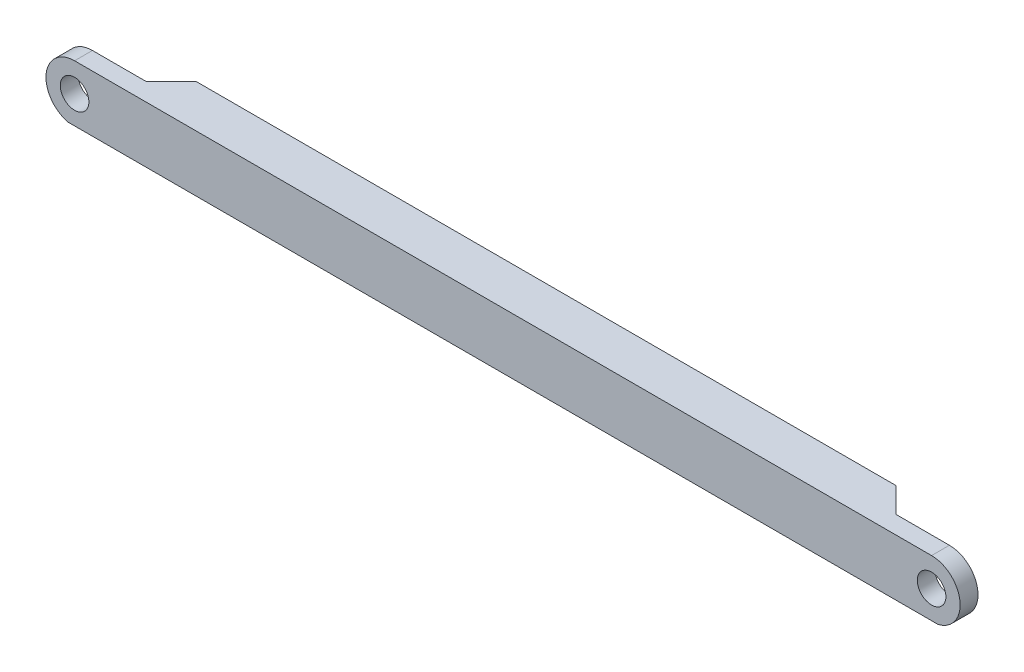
ISO-10303-21;
HEADER;
FILE_DESCRIPTION(('STEP AP214'),'2;1');
FILE_NAME('part.step','',(''),(''),'','','');
FILE_SCHEMA(('AUTOMOTIVE_DESIGN { 1 0 10303 214 1 1 1 1 }'));
ENDSEC;
DATA;
#1=APPLICATION_CONTEXT('core data for automotive mechanical design processes');
#2=APPLICATION_PROTOCOL_DEFINITION('international standard','automotive_design',2000,#1);
#3=PRODUCT_CONTEXT('',#1,'mechanical');
#4=PRODUCT('Part','Part','',(#3));
#5=PRODUCT_RELATED_PRODUCT_CATEGORY('part','',(#4));
#6=PRODUCT_DEFINITION_FORMATION('','',#4);
#7=PRODUCT_DEFINITION_CONTEXT('part definition',#1,'design');
#8=PRODUCT_DEFINITION('design','',#6,#7);
#9=PRODUCT_DEFINITION_SHAPE('','',#8);
#10=(LENGTH_UNIT() NAMED_UNIT(*) SI_UNIT(.MILLI.,.METRE.));
#11=(NAMED_UNIT(*) PLANE_ANGLE_UNIT() SI_UNIT($,.RADIAN.));
#12=(NAMED_UNIT(*) SI_UNIT($,.STERADIAN.) SOLID_ANGLE_UNIT());
#13=UNCERTAINTY_MEASURE_WITH_UNIT(LENGTH_MEASURE(1.E-05),#10,'distance_accuracy_value','');
#14=(GEOMETRIC_REPRESENTATION_CONTEXT(3) GLOBAL_UNCERTAINTY_ASSIGNED_CONTEXT((#13)) GLOBAL_UNIT_ASSIGNED_CONTEXT((#10,
#11,#12)) REPRESENTATION_CONTEXT('',''));
#15=CARTESIAN_POINT('',(0.,0.,0.));
#16=DIRECTION('',(0.,0.,1.));
#17=DIRECTION('',(1.,0.,0.));
#18=AXIS2_PLACEMENT_3D('',#15,#16,#17);
#19=CARTESIAN_POINT('',(0.,0.,0.));
#20=DIRECTION('',(0.,0.,-1.));
#21=DIRECTION('',(-1.,0.,0.));
#22=AXIS2_PLACEMENT_3D('',#19,#20,#21);
#23=PLANE('',#22);
#24=CARTESIAN_POINT('',(60.,2.00000000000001,0.));
#25=DIRECTION('',(0.,0.,-1.));
#26=DIRECTION('',(-1.,0.,0.));
#27=AXIS2_PLACEMENT_3D('',#24,#25,#26);
#28=CIRCLE('',#27,2.);
#29=CARTESIAN_POINT('',(58.,2.00000000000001,0.));
#30=VERTEX_POINT('',#29);
#31=EDGE_CURVE('E193',#30,#30,#28,.T.);
#32=ORIENTED_EDGE('',*,*,#31,.F.);
#33=EDGE_LOOP('',(#32));
#34=FACE_BOUND('',#33,.T.);
#35=CARTESIAN_POINT('',(60.,2.00000000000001,0.));
#36=DIRECTION('',(0.,0.,-1.));
#37=DIRECTION('',(1.,0.,0.));
#38=AXIS2_PLACEMENT_3D('',#35,#36,#37);
#39=CIRCLE('',#38,4.);
#40=CARTESIAN_POINT('',(60.,6.00000000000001,0.));
#41=VERTEX_POINT('',#40);
#42=CARTESIAN_POINT('',(60.8888194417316,-1.89999999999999,0.));
#43=VERTEX_POINT('',#42);
#44=EDGE_CURVE('E157',#41,#43,#39,.T.);
#45=ORIENTED_EDGE('',*,*,#44,.T.);
#46=DIRECTION('',(-1.,0.,0.));
#47=VECTOR('',#46,1.);
#48=CARTESIAN_POINT('',(0.,-1.9,0.));
#49=LINE('',#48,#47);
#50=CARTESIAN_POINT('',(52.5,-1.89999999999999,0.));
#51=VERTEX_POINT('',#50);
#52=EDGE_CURVE('E178',#43,#51,#49,.T.);
#53=ORIENTED_EDGE('',*,*,#52,.T.);
#54=DIRECTION('',(0.,1.,0.));
#55=VECTOR('',#54,1.);
#56=CARTESIAN_POINT('',(52.5,0.,0.));
#57=LINE('',#56,#55);
#58=CARTESIAN_POINT('',(52.5,6.00000000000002,0.));
#59=VERTEX_POINT('',#58);
#60=EDGE_CURVE('E60',#51,#59,#57,.T.);
#61=ORIENTED_EDGE('',*,*,#60,.T.);
#62=DIRECTION('',(-1.,0.,0.));
#63=VECTOR('',#62,1.);
#64=CARTESIAN_POINT('',(100.,6.00000000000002,0.));
#65=LINE('',#64,#63);
#66=EDGE_CURVE('E120',#41,#59,#65,.T.);
#67=ORIENTED_EDGE('',*,*,#66,.F.);
#68=EDGE_LOOP('',(#45,#53,#61,#67));
#69=FACE_BOUND('',#68,.T.);
#70=ADVANCED_FACE('F37',(#34,#69),#23,.T.);
#71=CARTESIAN_POINT('',(60.,2.00000000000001,0.));
#72=DIRECTION('',(0.,0.,1.));
#73=DIRECTION('',(1.,0.,0.));
#74=AXIS2_PLACEMENT_3D('',#71,#72,#73);
#75=CYLINDRICAL_SURFACE('',#74,4.);
#76=DIRECTION('',(0.,0.,1.));
#77=VECTOR('',#76,1.);
#78=CARTESIAN_POINT('',(60.8888194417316,-1.89999999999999,0.));
#79=LINE('',#78,#77);
#80=CARTESIAN_POINT('',(60.8888194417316,-1.89999999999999,2.49999999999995));
#81=VERTEX_POINT('',#80);
#82=EDGE_CURVE('E177',#43,#81,#79,.T.);
#83=ORIENTED_EDGE('',*,*,#82,.F.);
#84=ORIENTED_EDGE('',*,*,#44,.F.);
#85=DIRECTION('',(0.,0.,1.));
#86=VECTOR('',#85,1.);
#87=CARTESIAN_POINT('',(60.,6.00000000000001,0.));
#88=LINE('',#87,#86);
#89=CARTESIAN_POINT('',(60.,6.00000000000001,2.49999999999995));
#90=VERTEX_POINT('',#89);
#91=EDGE_CURVE('E138',#41,#90,#88,.T.);
#92=ORIENTED_EDGE('',*,*,#91,.T.);
#93=CARTESIAN_POINT('',(60.,2.00000000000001,2.49999999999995));
#94=DIRECTION('',(0.,0.,1.));
#95=DIRECTION('',(1.,0.,0.));
#96=AXIS2_PLACEMENT_3D('',#93,#94,#95);
#97=CIRCLE('',#96,4.);
#98=EDGE_CURVE('E142',#90,#81,#97,.F.);
#99=ORIENTED_EDGE('',*,*,#98,.T.);
#100=EDGE_LOOP('',(#83,#84,#92,#99));
#101=FACE_BOUND('',#100,.T.);
#102=ADVANCED_FACE('F176',(#101),#75,.T.);
#103=CARTESIAN_POINT('',(-60.,1.99999999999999,0.));
#104=DIRECTION('',(0.,0.,1.));
#105=DIRECTION('',(1.,0.,0.));
#106=AXIS2_PLACEMENT_3D('',#103,#104,#105);
#107=CYLINDRICAL_SURFACE('',#106,4.);
#108=DIRECTION('',(0.,0.,1.));
#109=VECTOR('',#108,1.);
#110=CARTESIAN_POINT('',(-60.8888194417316,-1.90000000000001,0.));
#111=LINE('',#110,#109);
#112=CARTESIAN_POINT('',(-60.8888194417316,-1.90000000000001,2.49999999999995));
#113=VERTEX_POINT('',#112);
#114=CARTESIAN_POINT('',(-60.8888194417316,-1.90000000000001,0.));
#115=VERTEX_POINT('',#114);
#116=EDGE_CURVE('E169',#113,#115,#111,.F.);
#117=ORIENTED_EDGE('',*,*,#116,.F.);
#118=CARTESIAN_POINT('',(-60.,1.99999999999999,2.49999999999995));
#119=DIRECTION('',(0.,0.,1.));
#120=DIRECTION('',(1.,0.,0.));
#121=AXIS2_PLACEMENT_3D('',#118,#119,#120);
#122=CIRCLE('',#121,4.);
#123=CARTESIAN_POINT('',(-60.,5.99999999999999,2.49999999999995));
#124=VERTEX_POINT('',#123);
#125=EDGE_CURVE('E155',#113,#124,#122,.F.);
#126=ORIENTED_EDGE('',*,*,#125,.T.);
#127=DIRECTION('',(0.,0.,1.));
#128=VECTOR('',#127,1.);
#129=CARTESIAN_POINT('',(-60.,5.99999999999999,0.));
#130=LINE('',#129,#128);
#131=CARTESIAN_POINT('',(-60.,5.99999999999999,0.));
#132=VERTEX_POINT('',#131);
#133=EDGE_CURVE('E161',#132,#124,#130,.T.);
#134=ORIENTED_EDGE('',*,*,#133,.F.);
#135=CARTESIAN_POINT('',(-60.,1.99999999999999,0.));
#136=DIRECTION('',(0.,0.,-1.));
#137=DIRECTION('',(1.,0.,0.));
#138=AXIS2_PLACEMENT_3D('',#135,#136,#137);
#139=CIRCLE('',#138,4.);
#140=EDGE_CURVE('E134',#115,#132,#139,.T.);
#141=ORIENTED_EDGE('',*,*,#140,.F.);
#142=EDGE_LOOP('',(#117,#126,#134,#141));
#143=FACE_BOUND('',#142,.T.);
#144=ADVANCED_FACE('F167',(#143),#107,.T.);
#145=CARTESIAN_POINT('',(-60.,1.99999999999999,0.));
#146=DIRECTION('',(0.,0.,-1.));
#147=DIRECTION('',(-1.,0.,0.));
#148=AXIS2_PLACEMENT_3D('',#145,#146,#147);
#149=CIRCLE('',#148,2.);
#150=CARTESIAN_POINT('',(-62.,1.99999999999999,0.));
#151=VERTEX_POINT('',#150);
#152=EDGE_CURVE('E198',#151,#151,#149,.T.);
#153=ORIENTED_EDGE('',*,*,#152,.F.);
#154=EDGE_LOOP('',(#153));
#155=FACE_BOUND('',#154,.T.);
#156=DIRECTION('',(0.,-1.,0.));
#157=VECTOR('',#156,1.);
#158=CARTESIAN_POINT('',(-52.5,0.,0.));
#159=LINE('',#158,#157);
#160=CARTESIAN_POINT('',(-52.5,6.,0.));
#161=VERTEX_POINT('',#160);
#162=CARTESIAN_POINT('',(-52.5,-1.9,0.));
#163=VERTEX_POINT('',#162);
#164=EDGE_CURVE('E45',#161,#163,#159,.T.);
#165=ORIENTED_EDGE('',*,*,#164,.T.);
#166=DIRECTION('',(-1.,0.,0.));
#167=VECTOR('',#166,1.);
#168=CARTESIAN_POINT('',(0.,-1.9,0.));
#169=LINE('',#168,#167);
#170=EDGE_CURVE('E52',#163,#115,#169,.T.);
#171=ORIENTED_EDGE('',*,*,#170,.T.);
#172=ORIENTED_EDGE('',*,*,#140,.T.);
#173=EDGE_CURVE('E123',#161,#132,#65,.T.);
#174=ORIENTED_EDGE('',*,*,#173,.F.);
#175=EDGE_LOOP('',(#165,#171,#172,#174));
#176=FACE_BOUND('',#175,.T.);
#177=ADVANCED_FACE('F131',(#155,#176),#23,.T.);
#178=CARTESIAN_POINT('',(-125.,-64.,2.49999999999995));
#179=DIRECTION('',(0.,0.,1.));
#180=DIRECTION('',(1.,0.,0.));
#181=AXIS2_PLACEMENT_3D('',#178,#179,#180);
#182=PLANE('',#181);
#183=CARTESIAN_POINT('',(-60.,1.99999999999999,2.49999999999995));
#184=DIRECTION('',(0.,0.,1.));
#185=DIRECTION('',(1.,0.,0.));
#186=AXIS2_PLACEMENT_3D('',#183,#184,#185);
#187=CIRCLE('',#186,2.);
#188=CARTESIAN_POINT('',(-58.,1.99999999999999,2.49999999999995));
#189=VERTEX_POINT('',#188);
#190=EDGE_CURVE('E190',#189,#189,#187,.T.);
#191=ORIENTED_EDGE('',*,*,#190,.F.);
#192=EDGE_LOOP('',(#191));
#193=FACE_BOUND('',#192,.T.);
#194=CARTESIAN_POINT('',(60.,2.00000000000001,2.49999999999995));
#195=DIRECTION('',(0.,0.,1.));
#196=DIRECTION('',(1.,0.,0.));
#197=AXIS2_PLACEMENT_3D('',#194,#195,#196);
#198=CIRCLE('',#197,2.);
#199=CARTESIAN_POINT('',(62.,2.00000000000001,2.49999999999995));
#200=VERTEX_POINT('',#199);
#201=EDGE_CURVE('E179',#200,#200,#198,.T.);
#202=ORIENTED_EDGE('',*,*,#201,.F.);
#203=EDGE_LOOP('',(#202));
#204=FACE_BOUND('',#203,.T.);
#205=ORIENTED_EDGE('',*,*,#125,.F.);
#206=DIRECTION('',(1.,0.,0.));
#207=VECTOR('',#206,1.);
#208=CARTESIAN_POINT('',(-125.,-1.90000000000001,2.49999999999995));
#209=LINE('',#208,#207);
#210=EDGE_CURVE('E173',#113,#81,#209,.T.);
#211=ORIENTED_EDGE('',*,*,#210,.T.);
#212=ORIENTED_EDGE('',*,*,#98,.F.);
#213=DIRECTION('',(1.,0.,0.));
#214=VECTOR('',#213,1.);
#215=CARTESIAN_POINT('',(60.,6.00000000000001,2.49999999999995));
#216=LINE('',#215,#214);
#217=EDGE_CURVE('E146',#124,#90,#216,.T.);
#218=ORIENTED_EDGE('',*,*,#217,.F.);
#219=EDGE_LOOP('',(#205,#211,#212,#218));
#220=FACE_BOUND('',#219,.T.);
#221=ADVANCED_FACE('F172',(#193,#204,#220),#182,.T.);
#222=CARTESIAN_POINT('',(0.,0.,-3.5));
#223=DIRECTION('',(0.,0.,-1.));
#224=DIRECTION('',(-1.,0.,0.));
#225=AXIS2_PLACEMENT_3D('',#222,#223,#224);
#226=PLANE('',#225);
#227=CARTESIAN_POINT('',(-10.,2.,-3.5));
#228=DIRECTION('',(0.,0.,1.));
#229=DIRECTION('',(1.,0.,0.));
#230=AXIS2_PLACEMENT_3D('',#227,#228,#229);
#231=CIRCLE('',#230,2.6);
#232=CARTESIAN_POINT('',(-7.4,2.,-3.5));
#233=VERTEX_POINT('',#232);
#234=EDGE_CURVE('E209',#233,#233,#231,.T.);
#235=ORIENTED_EDGE('',*,*,#234,.T.);
#236=EDGE_LOOP('',(#235));
#237=FACE_BOUND('',#236,.T.);
#238=CARTESIAN_POINT('',(40.,1.99999999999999,-3.5));
#239=DIRECTION('',(0.,0.,1.));
#240=DIRECTION('',(1.,0.,0.));
#241=AXIS2_PLACEMENT_3D('',#238,#239,#240);
#242=CIRCLE('',#241,2.6);
#243=CARTESIAN_POINT('',(42.6,1.99999999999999,-3.5));
#244=VERTEX_POINT('',#243);
#245=EDGE_CURVE('E220',#244,#244,#242,.T.);
#246=ORIENTED_EDGE('',*,*,#245,.T.);
#247=EDGE_LOOP('',(#246));
#248=FACE_BOUND('',#247,.T.);
#249=CARTESIAN_POINT('',(30.,1.99999999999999,-3.5));
#250=DIRECTION('',(0.,0.,1.));
#251=DIRECTION('',(1.,0.,0.));
#252=AXIS2_PLACEMENT_3D('',#249,#250,#251);
#253=CIRCLE('',#252,2.6);
#254=CARTESIAN_POINT('',(32.6,1.99999999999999,-3.5));
#255=VERTEX_POINT('',#254);
#256=EDGE_CURVE('E227',#255,#255,#253,.T.);
#257=ORIENTED_EDGE('',*,*,#256,.T.);
#258=EDGE_LOOP('',(#257));
#259=FACE_BOUND('',#258,.T.);
#260=CARTESIAN_POINT('',(20.,1.99999999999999,-3.5));
#261=DIRECTION('',(0.,0.,1.));
#262=DIRECTION('',(1.,0.,0.));
#263=AXIS2_PLACEMENT_3D('',#260,#261,#262);
#264=CIRCLE('',#263,2.6);
#265=CARTESIAN_POINT('',(22.6,1.99999999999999,-3.5));
#266=VERTEX_POINT('',#265);
#267=EDGE_CURVE('E232',#266,#266,#264,.T.);
#268=ORIENTED_EDGE('',*,*,#267,.T.);
#269=EDGE_LOOP('',(#268));
#270=FACE_BOUND('',#269,.T.);
#271=CARTESIAN_POINT('',(-20.,2.00000000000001,-3.5));
#272=DIRECTION('',(0.,0.,1.));
#273=DIRECTION('',(1.,0.,0.));
#274=AXIS2_PLACEMENT_3D('',#271,#272,#273);
#275=CIRCLE('',#274,2.6);
#276=CARTESIAN_POINT('',(-17.4,2.00000000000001,-3.5));
#277=VERTEX_POINT('',#276);
#278=EDGE_CURVE('E202',#277,#277,#275,.T.);
#279=ORIENTED_EDGE('',*,*,#278,.T.);
#280=EDGE_LOOP('',(#279));
#281=FACE_BOUND('',#280,.T.);
#282=CARTESIAN_POINT('',(-30.,2.00000000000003,-3.5));
#283=DIRECTION('',(0.,0.,1.));
#284=DIRECTION('',(1.,0.,0.));
#285=AXIS2_PLACEMENT_3D('',#282,#283,#284);
#286=CIRCLE('',#285,2.6);
#287=CARTESIAN_POINT('',(-27.4,2.00000000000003,-3.5));
#288=VERTEX_POINT('',#287);
#289=EDGE_CURVE('E210',#288,#288,#286,.T.);
#290=ORIENTED_EDGE('',*,*,#289,.T.);
#291=EDGE_LOOP('',(#290));
#292=FACE_BOUND('',#291,.T.);
#293=CARTESIAN_POINT('',(-40.,2.00000000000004,-3.5));
#294=DIRECTION('',(0.,0.,1.));
#295=DIRECTION('',(1.,0.,0.));
#296=AXIS2_PLACEMENT_3D('',#293,#294,#295);
#297=CIRCLE('',#296,2.6);
#298=CARTESIAN_POINT('',(-37.4,2.00000000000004,-3.5));
#299=VERTEX_POINT('',#298);
#300=EDGE_CURVE('E201',#299,#299,#297,.T.);
#301=ORIENTED_EDGE('',*,*,#300,.T.);
#302=EDGE_LOOP('',(#301));
#303=FACE_BOUND('',#302,.T.);
#304=CARTESIAN_POINT('',(10.,1.99999999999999,-3.5));
#305=DIRECTION('',(0.,0.,1.));
#306=DIRECTION('',(1.,0.,0.));
#307=AXIS2_PLACEMENT_3D('',#304,#305,#306);
#308=CIRCLE('',#307,2.6);
#309=CARTESIAN_POINT('',(12.6,1.99999999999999,-3.5));
#310=VERTEX_POINT('',#309);
#311=EDGE_CURVE('E239',#310,#310,#308,.T.);
#312=ORIENTED_EDGE('',*,*,#311,.T.);
#313=EDGE_LOOP('',(#312));
#314=FACE_BOUND('',#313,.T.);
#315=CARTESIAN_POINT('',(0.,1.99999999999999,-3.5));
#316=DIRECTION('',(0.,0.,1.));
#317=DIRECTION('',(1.,0.,0.));
#318=AXIS2_PLACEMENT_3D('',#315,#316,#317);
#319=CIRCLE('',#318,2.6);
#320=CARTESIAN_POINT('',(2.6,1.99999999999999,-3.5));
#321=VERTEX_POINT('',#320);
#322=EDGE_CURVE('E149',#321,#321,#319,.T.);
#323=ORIENTED_EDGE('',*,*,#322,.T.);
#324=EDGE_LOOP('',(#323));
#325=FACE_BOUND('',#324,.T.);
#326=DIRECTION('',(0.,-1.,0.));
#327=VECTOR('',#326,1.);
#328=CARTESIAN_POINT('',(48.9999999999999,-1.99999999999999,-3.5));
#329=LINE('',#328,#327);
#330=CARTESIAN_POINT('',(48.9999999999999,6.00000000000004,-3.5));
#331=VERTEX_POINT('',#330);
#332=CARTESIAN_POINT('',(48.9999999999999,-1.89999999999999,-3.5));
#333=VERTEX_POINT('',#332);
#334=EDGE_CURVE('E115',#331,#333,#329,.T.);
#335=ORIENTED_EDGE('',*,*,#334,.T.);
#336=DIRECTION('',(-1.,0.,0.));
#337=VECTOR('',#336,1.);
#338=CARTESIAN_POINT('',(0.,-1.9,-3.5));
#339=LINE('',#338,#337);
#340=CARTESIAN_POINT('',(-48.9999999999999,-1.9,-3.5));
#341=VERTEX_POINT('',#340);
#342=EDGE_CURVE('E102',#333,#341,#339,.T.);
#343=ORIENTED_EDGE('',*,*,#342,.T.);
#344=DIRECTION('',(0.,1.,0.));
#345=VECTOR('',#344,1.);
#346=CARTESIAN_POINT('',(-48.9999999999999,6.00000000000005,-3.5));
#347=LINE('',#346,#345);
#348=CARTESIAN_POINT('',(-48.9999999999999,6.00000000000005,-3.5));
#349=VERTEX_POINT('',#348);
#350=EDGE_CURVE('E112',#341,#349,#347,.T.);
#351=ORIENTED_EDGE('',*,*,#350,.T.);
#352=DIRECTION('',(1.,0.,0.));
#353=VECTOR('',#352,1.);
#354=CARTESIAN_POINT('',(54.,6.00000000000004,-3.5));
#355=LINE('',#354,#353);
#356=EDGE_CURVE('E140',#349,#331,#355,.T.);
#357=ORIENTED_EDGE('',*,*,#356,.T.);
#358=EDGE_LOOP('',(#335,#343,#351,#357));
#359=FACE_BOUND('',#358,.T.);
#360=ADVANCED_FACE('F110',(#237,#248,#259,#270,#281,#292,#303,#314,#325,#359),#226,.T.);
#361=CARTESIAN_POINT('',(48.9999999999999,0.,-3.5));
#362=DIRECTION('',(0.707106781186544,0.,-0.707106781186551));
#363=DIRECTION('',(0.,1.,0.));
#364=AXIS2_PLACEMENT_3D('',#361,#362,#363);
#365=PLANE('',#364);
#366=ORIENTED_EDGE('',*,*,#60,.F.);
#367=DIRECTION('',(-0.707106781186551,0.,-0.707106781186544));
#368=VECTOR('',#367,1.);
#369=CARTESIAN_POINT('',(48.9999999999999,-1.89999999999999,-3.5));
#370=LINE('',#369,#368);
#371=EDGE_CURVE('E183',#51,#333,#370,.T.);
#372=ORIENTED_EDGE('',*,*,#371,.T.);
#373=ORIENTED_EDGE('',*,*,#334,.F.);
#374=DIRECTION('',(-0.707106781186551,0.,-0.707106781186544));
#375=VECTOR('',#374,1.);
#376=CARTESIAN_POINT('',(48.9999999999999,6.00000000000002,-3.5));
#377=LINE('',#376,#375);
#378=EDGE_CURVE('E128',#59,#331,#377,.T.);
#379=ORIENTED_EDGE('',*,*,#378,.F.);
#380=EDGE_LOOP('',(#366,#372,#373,#379));
#381=FACE_BOUND('',#380,.T.);
#382=ADVANCED_FACE('F182',(#381),#365,.T.);
#383=CARTESIAN_POINT('',(-48.9999999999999,0.,-3.5));
#384=DIRECTION('',(-0.707106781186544,0.,-0.707106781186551));
#385=DIRECTION('',(0.,-1.,0.));
#386=AXIS2_PLACEMENT_3D('',#383,#384,#385);
#387=PLANE('',#386);
#388=ORIENTED_EDGE('',*,*,#350,.F.);
#389=DIRECTION('',(-0.707106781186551,0.,0.707106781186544));
#390=VECTOR('',#389,1.);
#391=CARTESIAN_POINT('',(-48.9999999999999,-1.9,-3.5));
#392=LINE('',#391,#390);
#393=EDGE_CURVE('E12',#341,#163,#392,.T.);
#394=ORIENTED_EDGE('',*,*,#393,.T.);
#395=ORIENTED_EDGE('',*,*,#164,.F.);
#396=DIRECTION('',(-0.707106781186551,0.,0.707106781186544));
#397=VECTOR('',#396,1.);
#398=CARTESIAN_POINT('',(-48.9999999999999,6.,-3.5));
#399=LINE('',#398,#397);
#400=EDGE_CURVE('E118',#349,#161,#399,.T.);
#401=ORIENTED_EDGE('',*,*,#400,.F.);
#402=EDGE_LOOP('',(#388,#394,#395,#401));
#403=FACE_BOUND('',#402,.T.);
#404=ADVANCED_FACE('F39',(#403),#387,.T.);
#405=CARTESIAN_POINT('',(100.,6.00000000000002,10.));
#406=DIRECTION('',(0.,-1.,0.));
#407=DIRECTION('',(1.,0.,0.));
#408=AXIS2_PLACEMENT_3D('',#405,#406,#407);
#409=PLANE('',#408);
#410=ORIENTED_EDGE('',*,*,#66,.T.);
#411=ORIENTED_EDGE('',*,*,#378,.T.);
#412=ORIENTED_EDGE('',*,*,#356,.F.);
#413=ORIENTED_EDGE('',*,*,#400,.T.);
#414=ORIENTED_EDGE('',*,*,#173,.T.);
#415=ORIENTED_EDGE('',*,*,#133,.T.);
#416=ORIENTED_EDGE('',*,*,#217,.T.);
#417=ORIENTED_EDGE('',*,*,#91,.F.);
#418=EDGE_LOOP('',(#410,#411,#412,#413,#414,#415,#416,#417));
#419=FACE_BOUND('',#418,.T.);
#420=ADVANCED_FACE('F139',(#419),#409,.F.);
#421=CARTESIAN_POINT('',(0.,1.99999999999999,9.85391052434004));
#422=DIRECTION('',(0.,0.,-1.));
#423=DIRECTION('',(-1.,0.,0.));
#424=AXIS2_PLACEMENT_3D('',#421,#422,#423);
#425=CYLINDRICAL_SURFACE('',#424,2.6);
#426=CARTESIAN_POINT('',(0.,1.99999999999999,1.59999999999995));
#427=DIRECTION('',(0.,0.,1.));
#428=DIRECTION('',(1.,0.,0.));
#429=AXIS2_PLACEMENT_3D('',#426,#427,#428);
#430=CIRCLE('',#429,2.6);
#431=CARTESIAN_POINT('',(2.6,1.99999999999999,1.59999999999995));
#432=VERTEX_POINT('',#431);
#433=EDGE_CURVE('E143',#432,#432,#430,.T.);
#434=ORIENTED_EDGE('',*,*,#433,.T.);
#435=EDGE_LOOP('',(#434));
#436=FACE_BOUND('',#435,.T.);
#437=ORIENTED_EDGE('',*,*,#322,.F.);
#438=EDGE_LOOP('',(#437));
#439=FACE_BOUND('',#438,.T.);
#440=ADVANCED_FACE('F252',(#436,#439),#425,.F.);
#441=CARTESIAN_POINT('',(-125.,-64.,1.59999999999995));
#442=DIRECTION('',(0.,0.,1.));
#443=DIRECTION('',(1.,0.,0.));
#444=AXIS2_PLACEMENT_3D('',#441,#442,#443);
#445=PLANE('',#444);
#446=ORIENTED_EDGE('',*,*,#433,.F.);
#447=EDGE_LOOP('',(#446));
#448=FACE_BOUND('',#447,.T.);
#449=ADVANCED_FACE('F254',(#448),#445,.F.);
#450=CARTESIAN_POINT('',(10.,1.99999999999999,9.85391052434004));
#451=DIRECTION('',(0.,0.,-1.));
#452=DIRECTION('',(-1.,0.,0.));
#453=AXIS2_PLACEMENT_3D('',#450,#451,#452);
#454=CYLINDRICAL_SURFACE('',#453,2.6);
#455=CARTESIAN_POINT('',(10.,1.99999999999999,1.59999999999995));
#456=DIRECTION('',(0.,0.,1.));
#457=DIRECTION('',(1.,0.,0.));
#458=AXIS2_PLACEMENT_3D('',#455,#456,#457);
#459=CIRCLE('',#458,2.6);
#460=CARTESIAN_POINT('',(12.6,1.99999999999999,1.59999999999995));
#461=VERTEX_POINT('',#460);
#462=EDGE_CURVE('E246',#461,#461,#459,.T.);
#463=ORIENTED_EDGE('',*,*,#462,.T.);
#464=EDGE_LOOP('',(#463));
#465=FACE_BOUND('',#464,.T.);
#466=ORIENTED_EDGE('',*,*,#311,.F.);
#467=EDGE_LOOP('',(#466));
#468=FACE_BOUND('',#467,.T.);
#469=ADVANCED_FACE('F261',(#465,#468),#454,.F.);
#470=CARTESIAN_POINT('',(-125.,-64.,1.59999999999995));
#471=DIRECTION('',(0.,0.,1.));
#472=DIRECTION('',(1.,0.,0.));
#473=AXIS2_PLACEMENT_3D('',#470,#471,#472);
#474=PLANE('',#473);
#475=ORIENTED_EDGE('',*,*,#462,.F.);
#476=EDGE_LOOP('',(#475));
#477=FACE_BOUND('',#476,.T.);
#478=ADVANCED_FACE('F331',(#477),#474,.F.);
#479=CARTESIAN_POINT('',(-40.,2.00000000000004,9.85391052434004));
#480=DIRECTION('',(0.,0.,-1.));
#481=DIRECTION('',(-1.,0.,0.));
#482=AXIS2_PLACEMENT_3D('',#479,#480,#481);
#483=CYLINDRICAL_SURFACE('',#482,2.6);
#484=CARTESIAN_POINT('',(-40.,2.00000000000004,1.59999999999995));
#485=DIRECTION('',(0.,0.,1.));
#486=DIRECTION('',(1.,0.,0.));
#487=AXIS2_PLACEMENT_3D('',#484,#485,#486);
#488=CIRCLE('',#487,2.6);
#489=CARTESIAN_POINT('',(-37.4,2.00000000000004,1.59999999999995));
#490=VERTEX_POINT('',#489);
#491=EDGE_CURVE('E213',#490,#490,#488,.T.);
#492=ORIENTED_EDGE('',*,*,#491,.T.);
#493=EDGE_LOOP('',(#492));
#494=FACE_BOUND('',#493,.T.);
#495=ORIENTED_EDGE('',*,*,#300,.F.);
#496=EDGE_LOOP('',(#495));
#497=FACE_BOUND('',#496,.T.);
#498=ADVANCED_FACE('F328',(#494,#497),#483,.F.);
#499=CARTESIAN_POINT('',(-125.,-64.,1.59999999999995));
#500=DIRECTION('',(0.,0.,1.));
#501=DIRECTION('',(1.,0.,0.));
#502=AXIS2_PLACEMENT_3D('',#499,#500,#501);
#503=PLANE('',#502);
#504=ORIENTED_EDGE('',*,*,#491,.F.);
#505=EDGE_LOOP('',(#504));
#506=FACE_BOUND('',#505,.T.);
#507=ADVANCED_FACE('F323',(#506),#503,.F.);
#508=CARTESIAN_POINT('',(-30.,2.00000000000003,9.85391052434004));
#509=DIRECTION('',(0.,0.,-1.));
#510=DIRECTION('',(-1.,0.,0.));
#511=AXIS2_PLACEMENT_3D('',#508,#509,#510);
#512=CYLINDRICAL_SURFACE('',#511,2.6);
#513=CARTESIAN_POINT('',(-30.,2.00000000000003,1.59999999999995));
#514=DIRECTION('',(0.,0.,1.));
#515=DIRECTION('',(1.,0.,0.));
#516=AXIS2_PLACEMENT_3D('',#513,#514,#515);
#517=CIRCLE('',#516,2.6);
#518=CARTESIAN_POINT('',(-27.4,2.00000000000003,1.59999999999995));
#519=VERTEX_POINT('',#518);
#520=EDGE_CURVE('E206',#519,#519,#517,.T.);
#521=ORIENTED_EDGE('',*,*,#520,.T.);
#522=EDGE_LOOP('',(#521));
#523=FACE_BOUND('',#522,.T.);
#524=ORIENTED_EDGE('',*,*,#289,.F.);
#525=EDGE_LOOP('',(#524));
#526=FACE_BOUND('',#525,.T.);
#527=ADVANCED_FACE('F320',(#523,#526),#512,.F.);
#528=CARTESIAN_POINT('',(-125.,-64.,1.59999999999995));
#529=DIRECTION('',(0.,0.,1.));
#530=DIRECTION('',(1.,0.,0.));
#531=AXIS2_PLACEMENT_3D('',#528,#529,#530);
#532=PLANE('',#531);
#533=ORIENTED_EDGE('',*,*,#520,.F.);
#534=EDGE_LOOP('',(#533));
#535=FACE_BOUND('',#534,.T.);
#536=ADVANCED_FACE('F314',(#535),#532,.F.);
#537=CARTESIAN_POINT('',(-20.,2.00000000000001,9.85391052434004));
#538=DIRECTION('',(0.,0.,-1.));
#539=DIRECTION('',(-1.,0.,0.));
#540=AXIS2_PLACEMENT_3D('',#537,#538,#539);
#541=CYLINDRICAL_SURFACE('',#540,2.6);
#542=CARTESIAN_POINT('',(-20.,2.00000000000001,1.59999999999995));
#543=DIRECTION('',(0.,0.,1.));
#544=DIRECTION('',(1.,0.,0.));
#545=AXIS2_PLACEMENT_3D('',#542,#543,#544);
#546=CIRCLE('',#545,2.6);
#547=CARTESIAN_POINT('',(-17.4,2.00000000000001,1.59999999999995));
#548=VERTEX_POINT('',#547);
#549=EDGE_CURVE('E205',#548,#548,#546,.T.);
#550=ORIENTED_EDGE('',*,*,#549,.T.);
#551=EDGE_LOOP('',(#550));
#552=FACE_BOUND('',#551,.T.);
#553=ORIENTED_EDGE('',*,*,#278,.F.);
#554=EDGE_LOOP('',(#553));
#555=FACE_BOUND('',#554,.T.);
#556=ADVANCED_FACE('F310',(#552,#555),#541,.F.);
#557=CARTESIAN_POINT('',(-125.,-64.,1.59999999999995));
#558=DIRECTION('',(0.,0.,1.));
#559=DIRECTION('',(1.,0.,0.));
#560=AXIS2_PLACEMENT_3D('',#557,#558,#559);
#561=PLANE('',#560);
#562=ORIENTED_EDGE('',*,*,#549,.F.);
#563=EDGE_LOOP('',(#562));
#564=FACE_BOUND('',#563,.T.);
#565=ADVANCED_FACE('F313',(#564),#561,.F.);
#566=CARTESIAN_POINT('',(20.,1.99999999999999,9.85391052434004));
#567=DIRECTION('',(0.,0.,-1.));
#568=DIRECTION('',(-1.,0.,0.));
#569=AXIS2_PLACEMENT_3D('',#566,#567,#568);
#570=CYLINDRICAL_SURFACE('',#569,2.6);
#571=CARTESIAN_POINT('',(20.,1.99999999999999,1.59999999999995));
#572=DIRECTION('',(0.,0.,1.));
#573=DIRECTION('',(1.,0.,0.));
#574=AXIS2_PLACEMENT_3D('',#571,#572,#573);
#575=CIRCLE('',#574,2.6);
#576=CARTESIAN_POINT('',(22.6,1.99999999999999,1.59999999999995));
#577=VERTEX_POINT('',#576);
#578=EDGE_CURVE('E235',#577,#577,#575,.T.);
#579=ORIENTED_EDGE('',*,*,#578,.T.);
#580=EDGE_LOOP('',(#579));
#581=FACE_BOUND('',#580,.T.);
#582=ORIENTED_EDGE('',*,*,#267,.F.);
#583=EDGE_LOOP('',(#582));
#584=FACE_BOUND('',#583,.T.);
#585=ADVANCED_FACE('F318',(#581,#584),#570,.F.);
#586=CARTESIAN_POINT('',(-125.,-64.,1.59999999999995));
#587=DIRECTION('',(0.,0.,1.));
#588=DIRECTION('',(1.,0.,0.));
#589=AXIS2_PLACEMENT_3D('',#586,#587,#588);
#590=PLANE('',#589);
#591=ORIENTED_EDGE('',*,*,#578,.F.);
#592=EDGE_LOOP('',(#591));
#593=FACE_BOUND('',#592,.T.);
#594=ADVANCED_FACE('F350',(#593),#590,.F.);
#595=CARTESIAN_POINT('',(30.,1.99999999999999,9.85391052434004));
#596=DIRECTION('',(0.,0.,-1.));
#597=DIRECTION('',(-1.,0.,0.));
#598=AXIS2_PLACEMENT_3D('',#595,#596,#597);
#599=CYLINDRICAL_SURFACE('',#598,2.6);
#600=CARTESIAN_POINT('',(30.,1.99999999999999,1.59999999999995));
#601=DIRECTION('',(0.,0.,1.));
#602=DIRECTION('',(1.,0.,0.));
#603=AXIS2_PLACEMENT_3D('',#600,#601,#602);
#604=CIRCLE('',#603,2.6);
#605=CARTESIAN_POINT('',(32.6,1.99999999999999,1.59999999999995));
#606=VERTEX_POINT('',#605);
#607=EDGE_CURVE('E236',#606,#606,#604,.T.);
#608=ORIENTED_EDGE('',*,*,#607,.T.);
#609=EDGE_LOOP('',(#608));
#610=FACE_BOUND('',#609,.T.);
#611=ORIENTED_EDGE('',*,*,#256,.F.);
#612=EDGE_LOOP('',(#611));
#613=FACE_BOUND('',#612,.T.);
#614=ADVANCED_FACE('F354',(#610,#613),#599,.F.);
#615=CARTESIAN_POINT('',(-125.,-64.,1.59999999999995));
#616=DIRECTION('',(0.,0.,1.));
#617=DIRECTION('',(1.,0.,0.));
#618=AXIS2_PLACEMENT_3D('',#615,#616,#617);
#619=PLANE('',#618);
#620=ORIENTED_EDGE('',*,*,#607,.F.);
#621=EDGE_LOOP('',(#620));
#622=FACE_BOUND('',#621,.T.);
#623=ADVANCED_FACE('F340',(#622),#619,.F.);
#624=CARTESIAN_POINT('',(40.,1.99999999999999,9.85391052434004));
#625=DIRECTION('',(0.,0.,-1.));
#626=DIRECTION('',(-1.,0.,0.));
#627=AXIS2_PLACEMENT_3D('',#624,#625,#626);
#628=CYLINDRICAL_SURFACE('',#627,2.6);
#629=CARTESIAN_POINT('',(40.,1.99999999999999,1.59999999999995));
#630=DIRECTION('',(0.,0.,1.));
#631=DIRECTION('',(1.,0.,0.));
#632=AXIS2_PLACEMENT_3D('',#629,#630,#631);
#633=CIRCLE('',#632,2.6);
#634=CARTESIAN_POINT('',(42.6,1.99999999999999,1.59999999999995));
#635=VERTEX_POINT('',#634);
#636=EDGE_CURVE('E223',#635,#635,#633,.T.);
#637=ORIENTED_EDGE('',*,*,#636,.T.);
#638=EDGE_LOOP('',(#637));
#639=FACE_BOUND('',#638,.T.);
#640=ORIENTED_EDGE('',*,*,#245,.F.);
#641=EDGE_LOOP('',(#640));
#642=FACE_BOUND('',#641,.T.);
#643=ADVANCED_FACE('F336',(#639,#642),#628,.F.);
#644=CARTESIAN_POINT('',(-125.,-64.,1.59999999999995));
#645=DIRECTION('',(0.,0.,1.));
#646=DIRECTION('',(1.,0.,0.));
#647=AXIS2_PLACEMENT_3D('',#644,#645,#646);
#648=PLANE('',#647);
#649=ORIENTED_EDGE('',*,*,#636,.F.);
#650=EDGE_LOOP('',(#649));
#651=FACE_BOUND('',#650,.T.);
#652=ADVANCED_FACE('F339',(#651),#648,.F.);
#653=CARTESIAN_POINT('',(-10.,2.,9.85391052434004));
#654=DIRECTION('',(0.,0.,-1.));
#655=DIRECTION('',(-1.,0.,0.));
#656=AXIS2_PLACEMENT_3D('',#653,#654,#655);
#657=CYLINDRICAL_SURFACE('',#656,2.6);
#658=CARTESIAN_POINT('',(-10.,2.,1.59999999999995));
#659=DIRECTION('',(0.,0.,1.));
#660=DIRECTION('',(1.,0.,0.));
#661=AXIS2_PLACEMENT_3D('',#658,#659,#660);
#662=CIRCLE('',#661,2.6);
#663=CARTESIAN_POINT('',(-7.4,2.,1.59999999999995));
#664=VERTEX_POINT('',#663);
#665=EDGE_CURVE('E224',#664,#664,#662,.T.);
#666=ORIENTED_EDGE('',*,*,#665,.T.);
#667=EDGE_LOOP('',(#666));
#668=FACE_BOUND('',#667,.T.);
#669=ORIENTED_EDGE('',*,*,#234,.F.);
#670=EDGE_LOOP('',(#669));
#671=FACE_BOUND('',#670,.T.);
#672=ADVANCED_FACE('F305',(#668,#671),#657,.F.);
#673=CARTESIAN_POINT('',(-125.,-64.,1.59999999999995));
#674=DIRECTION('',(0.,0.,1.));
#675=DIRECTION('',(1.,0.,0.));
#676=AXIS2_PLACEMENT_3D('',#673,#674,#675);
#677=PLANE('',#676);
#678=ORIENTED_EDGE('',*,*,#665,.F.);
#679=EDGE_LOOP('',(#678));
#680=FACE_BOUND('',#679,.T.);
#681=ADVANCED_FACE('F299',(#680),#677,.F.);
#682=CARTESIAN_POINT('',(60.,2.00000000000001,-3.5));
#683=DIRECTION('',(0.,0.,1.));
#684=DIRECTION('',(1.,0.,0.));
#685=AXIS2_PLACEMENT_3D('',#682,#683,#684);
#686=CYLINDRICAL_SURFACE('',#685,2.);
#687=ORIENTED_EDGE('',*,*,#31,.T.);
#688=EDGE_LOOP('',(#687));
#689=FACE_BOUND('',#688,.T.);
#690=ORIENTED_EDGE('',*,*,#201,.T.);
#691=EDGE_LOOP('',(#690));
#692=FACE_BOUND('',#691,.T.);
#693=ADVANCED_FACE('F292',(#689,#692),#686,.F.);
#694=CARTESIAN_POINT('',(-60.,1.99999999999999,-3.5));
#695=DIRECTION('',(0.,0.,1.));
#696=DIRECTION('',(1.,0.,0.));
#697=AXIS2_PLACEMENT_3D('',#694,#695,#696);
#698=CYLINDRICAL_SURFACE('',#697,2.);
#699=ORIENTED_EDGE('',*,*,#152,.T.);
#700=EDGE_LOOP('',(#699));
#701=FACE_BOUND('',#700,.T.);
#702=ORIENTED_EDGE('',*,*,#190,.T.);
#703=EDGE_LOOP('',(#702));
#704=FACE_BOUND('',#703,.T.);
#705=ADVANCED_FACE('F289',(#701,#704),#698,.F.);
#706=CARTESIAN_POINT('',(0.,-1.9,0.));
#707=DIRECTION('',(0.,-1.,0.));
#708=DIRECTION('',(1.,0.,0.));
#709=AXIS2_PLACEMENT_3D('',#706,#707,#708);
#710=PLANE('',#709);
#711=ORIENTED_EDGE('',*,*,#82,.T.);
#712=ORIENTED_EDGE('',*,*,#210,.F.);
#713=ORIENTED_EDGE('',*,*,#116,.T.);
#714=ORIENTED_EDGE('',*,*,#170,.F.);
#715=ORIENTED_EDGE('',*,*,#393,.F.);
#716=ORIENTED_EDGE('',*,*,#342,.F.);
#717=ORIENTED_EDGE('',*,*,#371,.F.);
#718=ORIENTED_EDGE('',*,*,#52,.F.);
#719=EDGE_LOOP('',(#711,#712,#713,#714,#715,#716,#717,#718));
#720=FACE_BOUND('',#719,.T.);
#721=ADVANCED_FACE('F101',(#720),#710,.T.);
#722=CLOSED_SHELL('',(#70,#102,#144,#177,#221,#360,#382,#404,#420,#440,#449,#469,#478,#498,#507,
#527,#536,#556,#565,#585,#594,#614,#623,#643,#652,#672,#681,#693,#705,#721));
#723=MANIFOLD_SOLID_BREP('B2',#722);
#724=ADVANCED_BREP_SHAPE_REPRESENTATION('',(#18,#723),#14);
#725=SHAPE_DEFINITION_REPRESENTATION(#9,#724);
ENDSEC;
END-ISO-10303-21;
